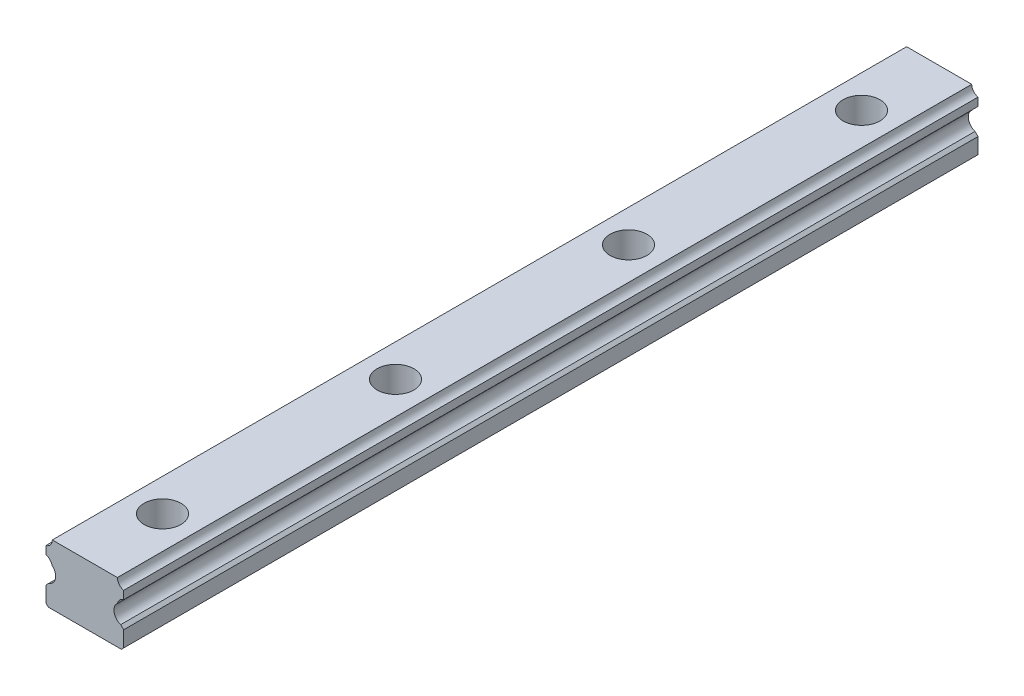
ISO-10303-21;
HEADER;
FILE_DESCRIPTION(('STEP AP214'),'2;1');
FILE_NAME('part.step','',(''),(''),'','','');
FILE_SCHEMA(('AUTOMOTIVE_DESIGN { 1 0 10303 214 1 1 1 1 }'));
ENDSEC;
DATA;
#1=APPLICATION_CONTEXT('core data for automotive mechanical design processes');
#2=APPLICATION_PROTOCOL_DEFINITION('international standard','automotive_design',2000,#1);
#3=PRODUCT_CONTEXT('',#1,'mechanical');
#4=PRODUCT('Part','Part','',(#3));
#5=PRODUCT_RELATED_PRODUCT_CATEGORY('part','',(#4));
#6=PRODUCT_DEFINITION_FORMATION('','',#4);
#7=PRODUCT_DEFINITION_CONTEXT('part definition',#1,'design');
#8=PRODUCT_DEFINITION('design','',#6,#7);
#9=PRODUCT_DEFINITION_SHAPE('','',#8);
#10=(LENGTH_UNIT() NAMED_UNIT(*) SI_UNIT(.MILLI.,.METRE.));
#11=(NAMED_UNIT(*) PLANE_ANGLE_UNIT() SI_UNIT($,.RADIAN.));
#12=(NAMED_UNIT(*) SI_UNIT($,.STERADIAN.) SOLID_ANGLE_UNIT());
#13=UNCERTAINTY_MEASURE_WITH_UNIT(LENGTH_MEASURE(1.E-05),#10,'distance_accuracy_value','');
#14=(GEOMETRIC_REPRESENTATION_CONTEXT(3) GLOBAL_UNCERTAINTY_ASSIGNED_CONTEXT((#13)) GLOBAL_UNIT_ASSIGNED_CONTEXT((#10,
#11,#12)) REPRESENTATION_CONTEXT('',''));
#15=CARTESIAN_POINT('',(0.,0.,0.));
#16=DIRECTION('',(0.,0.,1.));
#17=DIRECTION('',(1.,0.,0.));
#18=AXIS2_PLACEMENT_3D('',#15,#16,#17);
#19=CARTESIAN_POINT('',(-9.4,0.,110.));
#20=DIRECTION('',(0.,1.,0.));
#21=DIRECTION('',(0.,0.,1.));
#22=AXIS2_PLACEMENT_3D('',#19,#20,#21);
#23=PLANE('',#22);
#24=CARTESIAN_POINT('',(0.,0.,30.));
#25=DIRECTION('',(0.,1.,0.));
#26=DIRECTION('',(0.,0.,1.));
#27=AXIS2_PLACEMENT_3D('',#24,#25,#26);
#28=CIRCLE('',#27,3.);
#29=CARTESIAN_POINT('',(0.,0.,33.));
#30=VERTEX_POINT('',#29);
#31=EDGE_CURVE('E627',#30,#30,#28,.T.);
#32=ORIENTED_EDGE('',*,*,#31,.T.);
#33=EDGE_LOOP('',(#32));
#34=FACE_BOUND('',#33,.T.);
#35=CARTESIAN_POINT('',(0.,0.,-90.));
#36=DIRECTION('',(0.,1.,0.));
#37=DIRECTION('',(0.,0.,1.));
#38=AXIS2_PLACEMENT_3D('',#35,#36,#37);
#39=CIRCLE('',#38,3.);
#40=CARTESIAN_POINT('',(0.,0.,-87.));
#41=VERTEX_POINT('',#40);
#42=EDGE_CURVE('E601',#41,#41,#39,.T.);
#43=ORIENTED_EDGE('',*,*,#42,.T.);
#44=EDGE_LOOP('',(#43));
#45=FACE_BOUND('',#44,.T.);
#46=DIRECTION('',(0.,0.,-1.));
#47=VECTOR('',#46,1.);
#48=CARTESIAN_POINT('',(-9.4,0.,110.));
#49=LINE('',#48,#47);
#50=CARTESIAN_POINT('',(-9.4,0.,110.));
#51=VERTEX_POINT('',#50);
#52=CARTESIAN_POINT('',(-9.4,0.,-110.));
#53=VERTEX_POINT('',#52);
#54=EDGE_CURVE('E39',#51,#53,#49,.T.);
#55=ORIENTED_EDGE('',*,*,#54,.T.);
#56=DIRECTION('',(1.,0.,0.));
#57=VECTOR('',#56,1.);
#58=CARTESIAN_POINT('',(-9.4,0.,-110.));
#59=LINE('',#58,#57);
#60=CARTESIAN_POINT('',(9.4,0.,-110.));
#61=VERTEX_POINT('',#60);
#62=EDGE_CURVE('E160',#53,#61,#59,.T.);
#63=ORIENTED_EDGE('',*,*,#62,.T.);
#64=DIRECTION('',(0.,0.,-1.));
#65=VECTOR('',#64,1.);
#66=CARTESIAN_POINT('',(9.4,0.,110.));
#67=LINE('',#66,#65);
#68=CARTESIAN_POINT('',(9.4,0.,110.));
#69=VERTEX_POINT('',#68);
#70=EDGE_CURVE('E263',#69,#61,#67,.T.);
#71=ORIENTED_EDGE('',*,*,#70,.F.);
#72=DIRECTION('',(1.,0.,0.));
#73=VECTOR('',#72,1.);
#74=CARTESIAN_POINT('',(-9.4,0.,110.));
#75=LINE('',#74,#73);
#76=EDGE_CURVE('E212',#51,#69,#75,.T.);
#77=ORIENTED_EDGE('',*,*,#76,.F.);
#78=EDGE_LOOP('',(#55,#63,#71,#77));
#79=FACE_BOUND('',#78,.T.);
#80=CARTESIAN_POINT('',(0.,0.,90.));
#81=DIRECTION('',(0.,1.,0.));
#82=DIRECTION('',(0.,0.,1.));
#83=AXIS2_PLACEMENT_3D('',#80,#81,#82);
#84=CIRCLE('',#83,3.);
#85=CARTESIAN_POINT('',(0.,0.,93.));
#86=VERTEX_POINT('',#85);
#87=EDGE_CURVE('E615',#86,#86,#84,.T.);
#88=ORIENTED_EDGE('',*,*,#87,.T.);
#89=EDGE_LOOP('',(#88));
#90=FACE_BOUND('',#89,.T.);
#91=CARTESIAN_POINT('',(0.,0.,-30.));
#92=DIRECTION('',(0.,1.,0.));
#93=DIRECTION('',(0.,0.,1.));
#94=AXIS2_PLACEMENT_3D('',#91,#92,#93);
#95=CIRCLE('',#94,3.);
#96=CARTESIAN_POINT('',(0.,0.,-27.));
#97=VERTEX_POINT('',#96);
#98=EDGE_CURVE('E637',#97,#97,#95,.T.);
#99=ORIENTED_EDGE('',*,*,#98,.T.);
#100=EDGE_LOOP('',(#99));
#101=FACE_BOUND('',#100,.T.);
#102=ADVANCED_FACE('F31',(#34,#45,#79,#90,#101),#23,.F.);
#103=CARTESIAN_POINT('',(8.382,15.5,110.));
#104=DIRECTION('',(0.,-1.,0.));
#105=DIRECTION('',(0.,0.,-1.));
#106=AXIS2_PLACEMENT_3D('',#103,#104,#105);
#107=PLANE('',#106);
#108=CARTESIAN_POINT('',(0.,15.5,30.));
#109=DIRECTION('',(0.,1.,0.));
#110=DIRECTION('',(0.,0.,1.));
#111=AXIS2_PLACEMENT_3D('',#108,#109,#110);
#112=CIRCLE('',#111,4.75);
#113=CARTESIAN_POINT('',(0.,15.5,34.75));
#114=VERTEX_POINT('',#113);
#115=EDGE_CURVE('E618',#114,#114,#112,.T.);
#116=ORIENTED_EDGE('',*,*,#115,.F.);
#117=EDGE_LOOP('',(#116));
#118=FACE_BOUND('',#117,.T.);
#119=CARTESIAN_POINT('',(0.,15.5,-90.));
#120=DIRECTION('',(0.,1.,0.));
#121=DIRECTION('',(0.,0.,1.));
#122=AXIS2_PLACEMENT_3D('',#119,#120,#121);
#123=CIRCLE('',#122,4.75);
#124=CARTESIAN_POINT('',(0.,15.5,-85.25));
#125=VERTEX_POINT('',#124);
#126=EDGE_CURVE('E163',#125,#125,#123,.T.);
#127=ORIENTED_EDGE('',*,*,#126,.F.);
#128=EDGE_LOOP('',(#127));
#129=FACE_BOUND('',#128,.T.);
#130=DIRECTION('',(0.,0.,-1.));
#131=VECTOR('',#130,1.);
#132=CARTESIAN_POINT('',(8.382,15.5,110.));
#133=LINE('',#132,#131);
#134=CARTESIAN_POINT('',(8.382,15.5,110.));
#135=VERTEX_POINT('',#134);
#136=CARTESIAN_POINT('',(8.382,15.5,-110.));
#137=VERTEX_POINT('',#136);
#138=EDGE_CURVE('E249',#135,#137,#133,.T.);
#139=ORIENTED_EDGE('',*,*,#138,.T.);
#140=DIRECTION('',(-1.,0.,0.));
#141=VECTOR('',#140,1.);
#142=CARTESIAN_POINT('',(8.382,15.5,-110.));
#143=LINE('',#142,#141);
#144=CARTESIAN_POINT('',(-8.382,15.5,-110.));
#145=VERTEX_POINT('',#144);
#146=EDGE_CURVE('E192',#137,#145,#143,.T.);
#147=ORIENTED_EDGE('',*,*,#146,.T.);
#148=DIRECTION('',(0.,0.,-1.));
#149=VECTOR('',#148,1.);
#150=CARTESIAN_POINT('',(-8.382,15.5,110.));
#151=LINE('',#150,#149);
#152=CARTESIAN_POINT('',(-8.382,15.5,110.));
#153=VERTEX_POINT('',#152);
#154=EDGE_CURVE('E247',#153,#145,#151,.T.);
#155=ORIENTED_EDGE('',*,*,#154,.F.);
#156=DIRECTION('',(-1.,0.,0.));
#157=VECTOR('',#156,1.);
#158=CARTESIAN_POINT('',(8.382,15.5,110.));
#159=LINE('',#158,#157);
#160=EDGE_CURVE('E228',#135,#153,#159,.T.);
#161=ORIENTED_EDGE('',*,*,#160,.F.);
#162=EDGE_LOOP('',(#139,#147,#155,#161));
#163=FACE_BOUND('',#162,.T.);
#164=CARTESIAN_POINT('',(0.,15.5,90.));
#165=DIRECTION('',(0.,1.,0.));
#166=DIRECTION('',(0.,0.,1.));
#167=AXIS2_PLACEMENT_3D('',#164,#165,#166);
#168=CIRCLE('',#167,4.75);
#169=CARTESIAN_POINT('',(0.,15.5,94.75));
#170=VERTEX_POINT('',#169);
#171=EDGE_CURVE('E606',#170,#170,#168,.T.);
#172=ORIENTED_EDGE('',*,*,#171,.F.);
#173=EDGE_LOOP('',(#172));
#174=FACE_BOUND('',#173,.T.);
#175=CARTESIAN_POINT('',(0.,15.5,-30.));
#176=DIRECTION('',(0.,1.,0.));
#177=DIRECTION('',(0.,0.,1.));
#178=AXIS2_PLACEMENT_3D('',#175,#176,#177);
#179=CIRCLE('',#178,4.75);
#180=CARTESIAN_POINT('',(0.,15.5,-25.25));
#181=VERTEX_POINT('',#180);
#182=EDGE_CURVE('E629',#181,#181,#179,.T.);
#183=ORIENTED_EDGE('',*,*,#182,.F.);
#184=EDGE_LOOP('',(#183));
#185=FACE_BOUND('',#184,.T.);
#186=ADVANCED_FACE('F307',(#118,#129,#163,#174,#185),#107,.F.);
#187=CARTESIAN_POINT('',(-10.,4.652,110.));
#188=DIRECTION('',(1.,0.,0.));
#189=DIRECTION('',(0.,0.,-1.));
#190=AXIS2_PLACEMENT_3D('',#187,#188,#189);
#191=PLANE('',#190);
#192=DIRECTION('',(0.,0.,-1.));
#193=VECTOR('',#192,1.);
#194=CARTESIAN_POINT('',(-10.,4.652,110.));
#195=LINE('',#194,#193);
#196=CARTESIAN_POINT('',(-10.,4.652,110.));
#197=VERTEX_POINT('',#196);
#198=CARTESIAN_POINT('',(-10.,4.652,-110.));
#199=VERTEX_POINT('',#198);
#200=EDGE_CURVE('E162',#197,#199,#195,.T.);
#201=ORIENTED_EDGE('',*,*,#200,.T.);
#202=DIRECTION('',(0.,-1.,0.));
#203=VECTOR('',#202,1.);
#204=CARTESIAN_POINT('',(-10.,4.652,-110.));
#205=LINE('',#204,#203);
#206=CARTESIAN_POINT('',(-10.,0.6,-110.));
#207=VERTEX_POINT('',#206);
#208=EDGE_CURVE('E156',#199,#207,#205,.T.);
#209=ORIENTED_EDGE('',*,*,#208,.T.);
#210=DIRECTION('',(0.,0.,-1.));
#211=VECTOR('',#210,1.);
#212=CARTESIAN_POINT('',(-10.,0.6,110.));
#213=LINE('',#212,#211);
#214=CARTESIAN_POINT('',(-10.,0.6,110.));
#215=VERTEX_POINT('',#214);
#216=EDGE_CURVE('E11',#215,#207,#213,.T.);
#217=ORIENTED_EDGE('',*,*,#216,.F.);
#218=DIRECTION('',(0.,-1.,0.));
#219=VECTOR('',#218,1.);
#220=CARTESIAN_POINT('',(-10.,4.652,110.));
#221=LINE('',#220,#219);
#222=EDGE_CURVE('E209',#197,#215,#221,.T.);
#223=ORIENTED_EDGE('',*,*,#222,.F.);
#224=EDGE_LOOP('',(#201,#209,#217,#223));
#225=FACE_BOUND('',#224,.T.);
#226=ADVANCED_FACE('F33',(#225),#191,.F.);
#227=CARTESIAN_POINT('',(-10.,0.6,110.));
#228=DIRECTION('',(0.707106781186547,0.707106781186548,0.));
#229=DIRECTION('',(-0.707106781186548,0.707106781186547,0.));
#230=AXIS2_PLACEMENT_3D('',#227,#228,#229);
#231=PLANE('',#230);
#232=ORIENTED_EDGE('',*,*,#216,.T.);
#233=DIRECTION('',(0.707106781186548,-0.707106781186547,0.));
#234=VECTOR('',#233,1.);
#235=CARTESIAN_POINT('',(-10.,0.6,-110.));
#236=LINE('',#235,#234);
#237=EDGE_CURVE('E146',#207,#53,#236,.T.);
#238=ORIENTED_EDGE('',*,*,#237,.T.);
#239=ORIENTED_EDGE('',*,*,#54,.F.);
#240=DIRECTION('',(0.707106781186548,-0.707106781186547,0.));
#241=VECTOR('',#240,1.);
#242=CARTESIAN_POINT('',(-10.,0.6,110.));
#243=LINE('',#242,#241);
#244=EDGE_CURVE('E147',#215,#51,#243,.T.);
#245=ORIENTED_EDGE('',*,*,#244,.F.);
#246=EDGE_LOOP('',(#232,#238,#239,#245));
#247=FACE_BOUND('',#246,.T.);
#248=ADVANCED_FACE('F144',(#247),#231,.F.);
#249=CARTESIAN_POINT('',(9.4,0.,110.));
#250=DIRECTION('',(-0.707106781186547,0.707106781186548,0.));
#251=DIRECTION('',(-0.707106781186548,-0.707106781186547,0.));
#252=AXIS2_PLACEMENT_3D('',#249,#250,#251);
#253=PLANE('',#252);
#254=ORIENTED_EDGE('',*,*,#70,.T.);
#255=DIRECTION('',(0.707106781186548,0.707106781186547,0.));
#256=VECTOR('',#255,1.);
#257=CARTESIAN_POINT('',(9.4,0.,-110.));
#258=LINE('',#257,#256);
#259=CARTESIAN_POINT('',(10.,0.6,-110.));
#260=VERTEX_POINT('',#259);
#261=EDGE_CURVE('E171',#61,#260,#258,.T.);
#262=ORIENTED_EDGE('',*,*,#261,.T.);
#263=DIRECTION('',(0.,0.,-1.));
#264=VECTOR('',#263,1.);
#265=CARTESIAN_POINT('',(10.,0.6,110.));
#266=LINE('',#265,#264);
#267=CARTESIAN_POINT('',(10.,0.6,110.));
#268=VERTEX_POINT('',#267);
#269=EDGE_CURVE('E261',#268,#260,#266,.T.);
#270=ORIENTED_EDGE('',*,*,#269,.F.);
#271=DIRECTION('',(0.707106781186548,0.707106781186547,0.));
#272=VECTOR('',#271,1.);
#273=CARTESIAN_POINT('',(9.4,0.,110.));
#274=LINE('',#273,#272);
#275=EDGE_CURVE('E214',#69,#268,#274,.T.);
#276=ORIENTED_EDGE('',*,*,#275,.F.);
#277=EDGE_LOOP('',(#254,#262,#270,#276));
#278=FACE_BOUND('',#277,.T.);
#279=ADVANCED_FACE('F274',(#278),#253,.F.);
#280=CARTESIAN_POINT('',(10.,0.6,110.));
#281=DIRECTION('',(-1.,0.,0.));
#282=DIRECTION('',(0.,-1.,0.));
#283=AXIS2_PLACEMENT_3D('',#280,#281,#282);
#284=PLANE('',#283);
#285=ORIENTED_EDGE('',*,*,#269,.T.);
#286=DIRECTION('',(0.,1.,0.));
#287=VECTOR('',#286,1.);
#288=CARTESIAN_POINT('',(10.,0.6,-110.));
#289=LINE('',#288,#287);
#290=CARTESIAN_POINT('',(10.,4.652,-110.));
#291=VERTEX_POINT('',#290);
#292=EDGE_CURVE('E174',#260,#291,#289,.T.);
#293=ORIENTED_EDGE('',*,*,#292,.T.);
#294=DIRECTION('',(0.,0.,-1.));
#295=VECTOR('',#294,1.);
#296=CARTESIAN_POINT('',(10.,4.652,110.));
#297=LINE('',#296,#295);
#298=CARTESIAN_POINT('',(10.,4.652,110.));
#299=VERTEX_POINT('',#298);
#300=EDGE_CURVE('E259',#299,#291,#297,.T.);
#301=ORIENTED_EDGE('',*,*,#300,.F.);
#302=DIRECTION('',(0.,1.,0.));
#303=VECTOR('',#302,1.);
#304=CARTESIAN_POINT('',(10.,0.6,110.));
#305=LINE('',#304,#303);
#306=EDGE_CURVE('E216',#268,#299,#305,.T.);
#307=ORIENTED_EDGE('',*,*,#306,.F.);
#308=EDGE_LOOP('',(#285,#293,#301,#307));
#309=FACE_BOUND('',#308,.T.);
#310=ADVANCED_FACE('F277',(#309),#284,.F.);
#311=CARTESIAN_POINT('',(10.,4.652,110.));
#312=DIRECTION('',(-0.707106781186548,-0.707106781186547,0.));
#313=DIRECTION('',(0.707106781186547,-0.707106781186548,0.));
#314=AXIS2_PLACEMENT_3D('',#311,#312,#313);
#315=PLANE('',#314);
#316=ORIENTED_EDGE('',*,*,#300,.T.);
#317=DIRECTION('',(-0.707106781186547,0.707106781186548,0.));
#318=VECTOR('',#317,1.);
#319=CARTESIAN_POINT('',(10.,4.652,-110.));
#320=LINE('',#319,#318);
#321=CARTESIAN_POINT('',(9.23068875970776,5.42131124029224,-110.));
#322=VERTEX_POINT('',#321);
#323=EDGE_CURVE('E177',#291,#322,#320,.T.);
#324=ORIENTED_EDGE('',*,*,#323,.T.);
#325=DIRECTION('',(0.,0.,-1.));
#326=VECTOR('',#325,1.);
#327=CARTESIAN_POINT('',(9.23068875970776,5.42131124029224,110.));
#328=LINE('',#327,#326);
#329=CARTESIAN_POINT('',(9.23068875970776,5.42131124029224,110.));
#330=VERTEX_POINT('',#329);
#331=EDGE_CURVE('E257',#330,#322,#328,.T.);
#332=ORIENTED_EDGE('',*,*,#331,.F.);
#333=DIRECTION('',(-0.707106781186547,0.707106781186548,0.));
#334=VECTOR('',#333,1.);
#335=CARTESIAN_POINT('',(10.,4.652,110.));
#336=LINE('',#335,#334);
#337=EDGE_CURVE('E218',#299,#330,#336,.T.);
#338=ORIENTED_EDGE('',*,*,#337,.F.);
#339=EDGE_LOOP('',(#316,#324,#332,#338));
#340=FACE_BOUND('',#339,.T.);
#341=ADVANCED_FACE('F282',(#340),#315,.F.);
#342=CARTESIAN_POINT('',(10.,7.8,110.));
#343=DIRECTION('',(0.,0.,-1.));
#344=DIRECTION('',(-1.,0.,0.));
#345=AXIS2_PLACEMENT_3D('',#342,#343,#344);
#346=CYLINDRICAL_SURFACE('',#345,2.5);
#347=ORIENTED_EDGE('',*,*,#331,.T.);
#348=CARTESIAN_POINT('',(10.,7.8,-110.));
#349=DIRECTION('',(0.,0.,-1.));
#350=DIRECTION('',(-1.,0.,0.));
#351=AXIS2_PLACEMENT_3D('',#348,#349,#350);
#352=CIRCLE('',#351,2.5);
#353=CARTESIAN_POINT('',(8.42517245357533,9.74162771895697,-110.));
#354=VERTEX_POINT('',#353);
#355=EDGE_CURVE('E180',#322,#354,#352,.T.);
#356=ORIENTED_EDGE('',*,*,#355,.T.);
#357=DIRECTION('',(0.,0.,-1.));
#358=VECTOR('',#357,1.);
#359=CARTESIAN_POINT('',(8.42517245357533,9.74162771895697,110.));
#360=LINE('',#359,#358);
#361=CARTESIAN_POINT('',(8.42517245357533,9.74162771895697,110.));
#362=VERTEX_POINT('',#361);
#363=EDGE_CURVE('E255',#362,#354,#360,.T.);
#364=ORIENTED_EDGE('',*,*,#363,.F.);
#365=CARTESIAN_POINT('',(10.,7.8,110.));
#366=DIRECTION('',(0.,0.,-1.));
#367=DIRECTION('',(-1.,0.,0.));
#368=AXIS2_PLACEMENT_3D('',#365,#366,#367);
#369=CIRCLE('',#368,2.5);
#370=EDGE_CURVE('E220',#330,#362,#369,.T.);
#371=ORIENTED_EDGE('',*,*,#370,.F.);
#372=EDGE_LOOP('',(#347,#356,#364,#371));
#373=FACE_BOUND('',#372,.T.);
#374=ADVANCED_FACE('F288',(#373),#346,.F.);
#375=CARTESIAN_POINT('',(10.482,9.31799999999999,110.));
#376=DIRECTION('',(0.,0.,-1.));
#377=DIRECTION('',(-1.,0.,0.));
#378=AXIS2_PLACEMENT_3D('',#375,#376,#377);
#379=CYLINDRICAL_SURFACE('',#378,2.10000000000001);
#380=ORIENTED_EDGE('',*,*,#363,.T.);
#381=CARTESIAN_POINT('',(10.482,9.31799999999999,-110.));
#382=DIRECTION('',(0.,0.,-1.));
#383=DIRECTION('',(-1.,0.,0.));
#384=AXIS2_PLACEMENT_3D('',#381,#382,#383);
#385=CIRCLE('',#384,2.10000000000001);
#386=CARTESIAN_POINT('',(10.,11.3619363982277,-110.));
#387=VERTEX_POINT('',#386);
#388=EDGE_CURVE('E183',#354,#387,#385,.T.);
#389=ORIENTED_EDGE('',*,*,#388,.T.);
#390=DIRECTION('',(0.,0.,-1.));
#391=VECTOR('',#390,1.);
#392=CARTESIAN_POINT('',(10.,11.3619363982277,110.));
#393=LINE('',#392,#391);
#394=CARTESIAN_POINT('',(10.,11.3619363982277,110.));
#395=VERTEX_POINT('',#394);
#396=EDGE_CURVE('E253',#395,#387,#393,.T.);
#397=ORIENTED_EDGE('',*,*,#396,.F.);
#398=CARTESIAN_POINT('',(10.482,9.31799999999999,110.));
#399=DIRECTION('',(0.,0.,-1.));
#400=DIRECTION('',(-1.,0.,0.));
#401=AXIS2_PLACEMENT_3D('',#398,#399,#400);
#402=CIRCLE('',#401,2.10000000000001);
#403=EDGE_CURVE('E222',#362,#395,#402,.T.);
#404=ORIENTED_EDGE('',*,*,#403,.F.);
#405=EDGE_LOOP('',(#380,#389,#397,#404));
#406=FACE_BOUND('',#405,.T.);
#407=ADVANCED_FACE('F292',(#406),#379,.F.);
#408=CARTESIAN_POINT('',(10.,11.3619363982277,110.));
#409=DIRECTION('',(-1.,0.,0.));
#410=DIRECTION('',(0.,0.,1.));
#411=AXIS2_PLACEMENT_3D('',#408,#409,#410);
#412=PLANE('',#411);
#413=ORIENTED_EDGE('',*,*,#396,.T.);
#414=DIRECTION('',(0.,1.,0.));
#415=VECTOR('',#414,1.);
#416=CARTESIAN_POINT('',(10.,11.3619363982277,-110.));
#417=LINE('',#416,#415);
#418=CARTESIAN_POINT('',(10.,13.4560636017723,-110.));
#419=VERTEX_POINT('',#418);
#420=EDGE_CURVE('E186',#387,#419,#417,.T.);
#421=ORIENTED_EDGE('',*,*,#420,.T.);
#422=DIRECTION('',(0.,0.,-1.));
#423=VECTOR('',#422,1.);
#424=CARTESIAN_POINT('',(10.,13.4560636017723,110.));
#425=LINE('',#424,#423);
#426=CARTESIAN_POINT('',(10.,13.4560636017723,110.));
#427=VERTEX_POINT('',#426);
#428=EDGE_CURVE('E251',#427,#419,#425,.T.);
#429=ORIENTED_EDGE('',*,*,#428,.F.);
#430=DIRECTION('',(0.,1.,0.));
#431=VECTOR('',#430,1.);
#432=CARTESIAN_POINT('',(10.,11.3619363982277,110.));
#433=LINE('',#432,#431);
#434=EDGE_CURVE('E224',#395,#427,#433,.T.);
#435=ORIENTED_EDGE('',*,*,#434,.F.);
#436=EDGE_LOOP('',(#413,#421,#429,#435));
#437=FACE_BOUND('',#436,.T.);
#438=ADVANCED_FACE('F297',(#437),#412,.F.);
#439=CARTESIAN_POINT('',(10.482,15.5,110.));
#440=DIRECTION('',(0.,0.,-1.));
#441=DIRECTION('',(-1.,0.,0.));
#442=AXIS2_PLACEMENT_3D('',#439,#440,#441);
#443=CYLINDRICAL_SURFACE('',#442,2.1);
#444=ORIENTED_EDGE('',*,*,#428,.T.);
#445=CARTESIAN_POINT('',(10.482,15.5,-110.));
#446=DIRECTION('',(0.,0.,-1.));
#447=DIRECTION('',(-1.,0.,0.));
#448=AXIS2_PLACEMENT_3D('',#445,#446,#447);
#449=CIRCLE('',#448,2.1);
#450=EDGE_CURVE('E189',#419,#137,#449,.T.);
#451=ORIENTED_EDGE('',*,*,#450,.T.);
#452=ORIENTED_EDGE('',*,*,#138,.F.);
#453=CARTESIAN_POINT('',(10.482,15.5,110.));
#454=DIRECTION('',(0.,0.,-1.));
#455=DIRECTION('',(-1.,0.,0.));
#456=AXIS2_PLACEMENT_3D('',#453,#454,#455);
#457=CIRCLE('',#456,2.1);
#458=EDGE_CURVE('E226',#427,#135,#457,.T.);
#459=ORIENTED_EDGE('',*,*,#458,.F.);
#460=EDGE_LOOP('',(#444,#451,#452,#459));
#461=FACE_BOUND('',#460,.T.);
#462=ADVANCED_FACE('F303',(#461),#443,.F.);
#463=CARTESIAN_POINT('',(-10.482,15.5,110.));
#464=DIRECTION('',(0.,0.,-1.));
#465=DIRECTION('',(-1.,0.,0.));
#466=AXIS2_PLACEMENT_3D('',#463,#464,#465);
#467=CYLINDRICAL_SURFACE('',#466,2.10000000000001);
#468=ORIENTED_EDGE('',*,*,#154,.T.);
#469=CARTESIAN_POINT('',(-10.482,15.5,-110.));
#470=DIRECTION('',(0.,0.,-1.));
#471=DIRECTION('',(-1.,0.,0.));
#472=AXIS2_PLACEMENT_3D('',#469,#470,#471);
#473=CIRCLE('',#472,2.10000000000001);
#474=CARTESIAN_POINT('',(-10.,13.4560636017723,-110.));
#475=VERTEX_POINT('',#474);
#476=EDGE_CURVE('E195',#145,#475,#473,.T.);
#477=ORIENTED_EDGE('',*,*,#476,.T.);
#478=DIRECTION('',(0.,0.,-1.));
#479=VECTOR('',#478,1.);
#480=CARTESIAN_POINT('',(-10.,13.4560636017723,110.));
#481=LINE('',#480,#479);
#482=CARTESIAN_POINT('',(-10.,13.4560636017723,110.));
#483=VERTEX_POINT('',#482);
#484=EDGE_CURVE('E245',#483,#475,#481,.T.);
#485=ORIENTED_EDGE('',*,*,#484,.F.);
#486=CARTESIAN_POINT('',(-10.482,15.5,110.));
#487=DIRECTION('',(0.,0.,-1.));
#488=DIRECTION('',(-1.,0.,0.));
#489=AXIS2_PLACEMENT_3D('',#486,#487,#488);
#490=CIRCLE('',#489,2.10000000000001);
#491=EDGE_CURVE('E230',#153,#483,#490,.T.);
#492=ORIENTED_EDGE('',*,*,#491,.F.);
#493=EDGE_LOOP('',(#468,#477,#485,#492));
#494=FACE_BOUND('',#493,.T.);
#495=ADVANCED_FACE('F313',(#494),#467,.F.);
#496=CARTESIAN_POINT('',(-10.,13.4560636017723,110.));
#497=DIRECTION('',(1.,0.,0.));
#498=DIRECTION('',(0.,0.,-1.));
#499=AXIS2_PLACEMENT_3D('',#496,#497,#498);
#500=PLANE('',#499);
#501=ORIENTED_EDGE('',*,*,#484,.T.);
#502=DIRECTION('',(0.,-1.,0.));
#503=VECTOR('',#502,1.);
#504=CARTESIAN_POINT('',(-10.,13.4560636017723,-110.));
#505=LINE('',#504,#503);
#506=CARTESIAN_POINT('',(-10.,11.3619363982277,-110.));
#507=VERTEX_POINT('',#506);
#508=EDGE_CURVE('E198',#475,#507,#505,.T.);
#509=ORIENTED_EDGE('',*,*,#508,.T.);
#510=DIRECTION('',(0.,0.,-1.));
#511=VECTOR('',#510,1.);
#512=CARTESIAN_POINT('',(-10.,11.3619363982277,110.));
#513=LINE('',#512,#511);
#514=CARTESIAN_POINT('',(-10.,11.3619363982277,110.));
#515=VERTEX_POINT('',#514);
#516=EDGE_CURVE('E243',#515,#507,#513,.T.);
#517=ORIENTED_EDGE('',*,*,#516,.F.);
#518=DIRECTION('',(0.,-1.,0.));
#519=VECTOR('',#518,1.);
#520=CARTESIAN_POINT('',(-10.,13.4560636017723,110.));
#521=LINE('',#520,#519);
#522=EDGE_CURVE('E232',#483,#515,#521,.T.);
#523=ORIENTED_EDGE('',*,*,#522,.F.);
#524=EDGE_LOOP('',(#501,#509,#517,#523));
#525=FACE_BOUND('',#524,.T.);
#526=ADVANCED_FACE('F319',(#525),#500,.F.);
#527=CARTESIAN_POINT('',(-10.482,9.31799999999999,110.));
#528=DIRECTION('',(0.,0.,-1.));
#529=DIRECTION('',(-1.,0.,0.));
#530=AXIS2_PLACEMENT_3D('',#527,#528,#529);
#531=CYLINDRICAL_SURFACE('',#530,2.10000000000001);
#532=ORIENTED_EDGE('',*,*,#516,.T.);
#533=CARTESIAN_POINT('',(-10.482,9.31799999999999,-110.));
#534=DIRECTION('',(0.,0.,-1.));
#535=DIRECTION('',(-1.,0.,0.));
#536=AXIS2_PLACEMENT_3D('',#533,#534,#535);
#537=CIRCLE('',#536,2.10000000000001);
#538=CARTESIAN_POINT('',(-8.42517245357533,9.74162771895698,-110.));
#539=VERTEX_POINT('',#538);
#540=EDGE_CURVE('E201',#507,#539,#537,.T.);
#541=ORIENTED_EDGE('',*,*,#540,.T.);
#542=DIRECTION('',(0.,0.,-1.));
#543=VECTOR('',#542,1.);
#544=CARTESIAN_POINT('',(-8.42517245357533,9.74162771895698,110.));
#545=LINE('',#544,#543);
#546=CARTESIAN_POINT('',(-8.42517245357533,9.74162771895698,110.));
#547=VERTEX_POINT('',#546);
#548=EDGE_CURVE('E241',#547,#539,#545,.T.);
#549=ORIENTED_EDGE('',*,*,#548,.F.);
#550=CARTESIAN_POINT('',(-10.482,9.31799999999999,110.));
#551=DIRECTION('',(0.,0.,-1.));
#552=DIRECTION('',(-1.,0.,0.));
#553=AXIS2_PLACEMENT_3D('',#550,#551,#552);
#554=CIRCLE('',#553,2.10000000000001);
#555=EDGE_CURVE('E234',#515,#547,#554,.T.);
#556=ORIENTED_EDGE('',*,*,#555,.F.);
#557=EDGE_LOOP('',(#532,#541,#549,#556));
#558=FACE_BOUND('',#557,.T.);
#559=ADVANCED_FACE('F323',(#558),#531,.F.);
#560=CARTESIAN_POINT('',(-10.,7.8,110.));
#561=DIRECTION('',(0.,0.,-1.));
#562=DIRECTION('',(-1.,0.,0.));
#563=AXIS2_PLACEMENT_3D('',#560,#561,#562);
#564=CYLINDRICAL_SURFACE('',#563,2.5);
#565=ORIENTED_EDGE('',*,*,#548,.T.);
#566=CARTESIAN_POINT('',(-10.,7.8,-110.));
#567=DIRECTION('',(0.,0.,-1.));
#568=DIRECTION('',(-1.,0.,0.));
#569=AXIS2_PLACEMENT_3D('',#566,#567,#568);
#570=CIRCLE('',#569,2.5);
#571=CARTESIAN_POINT('',(-9.23068875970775,5.42131124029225,-110.));
#572=VERTEX_POINT('',#571);
#573=EDGE_CURVE('E204',#539,#572,#570,.T.);
#574=ORIENTED_EDGE('',*,*,#573,.T.);
#575=DIRECTION('',(0.,0.,-1.));
#576=VECTOR('',#575,1.);
#577=CARTESIAN_POINT('',(-9.23068875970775,5.42131124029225,110.));
#578=LINE('',#577,#576);
#579=CARTESIAN_POINT('',(-9.23068875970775,5.42131124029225,110.));
#580=VERTEX_POINT('',#579);
#581=EDGE_CURVE('E239',#580,#572,#578,.T.);
#582=ORIENTED_EDGE('',*,*,#581,.F.);
#583=CARTESIAN_POINT('',(-10.,7.8,110.));
#584=DIRECTION('',(0.,0.,-1.));
#585=DIRECTION('',(-1.,0.,0.));
#586=AXIS2_PLACEMENT_3D('',#583,#584,#585);
#587=CIRCLE('',#586,2.5);
#588=EDGE_CURVE('E51',#547,#580,#587,.T.);
#589=ORIENTED_EDGE('',*,*,#588,.F.);
#590=EDGE_LOOP('',(#565,#574,#582,#589));
#591=FACE_BOUND('',#590,.T.);
#592=ADVANCED_FACE('F326',(#591),#564,.F.);
#593=CARTESIAN_POINT('',(-9.23068875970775,5.42131124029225,110.));
#594=DIRECTION('',(0.707106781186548,-0.707106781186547,0.));
#595=DIRECTION('',(0.707106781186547,0.707106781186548,0.));
#596=AXIS2_PLACEMENT_3D('',#593,#594,#595);
#597=PLANE('',#596);
#598=ORIENTED_EDGE('',*,*,#581,.T.);
#599=DIRECTION('',(-0.707106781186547,-0.707106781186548,0.));
#600=VECTOR('',#599,1.);
#601=CARTESIAN_POINT('',(-9.23068875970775,5.42131124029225,-110.));
#602=LINE('',#601,#600);
#603=EDGE_CURVE('E207',#572,#199,#602,.T.);
#604=ORIENTED_EDGE('',*,*,#603,.T.);
#605=ORIENTED_EDGE('',*,*,#200,.F.);
#606=DIRECTION('',(-0.707106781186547,-0.707106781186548,0.));
#607=VECTOR('',#606,1.);
#608=CARTESIAN_POINT('',(-9.23068875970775,5.42131124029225,110.));
#609=LINE('',#608,#607);
#610=EDGE_CURVE('E46',#580,#197,#609,.T.);
#611=ORIENTED_EDGE('',*,*,#610,.F.);
#612=EDGE_LOOP('',(#598,#604,#605,#611));
#613=FACE_BOUND('',#612,.T.);
#614=ADVANCED_FACE('F328',(#613),#597,.F.);
#615=CARTESIAN_POINT('',(10.,7.8,110.));
#616=DIRECTION('',(0.,0.,-1.));
#617=DIRECTION('',(-1.,0.,0.));
#618=AXIS2_PLACEMENT_3D('',#615,#616,#617);
#619=PLANE('',#618);
#620=ORIENTED_EDGE('',*,*,#222,.T.);
#621=ORIENTED_EDGE('',*,*,#244,.T.);
#622=ORIENTED_EDGE('',*,*,#76,.T.);
#623=ORIENTED_EDGE('',*,*,#275,.T.);
#624=ORIENTED_EDGE('',*,*,#306,.T.);
#625=ORIENTED_EDGE('',*,*,#337,.T.);
#626=ORIENTED_EDGE('',*,*,#370,.T.);
#627=ORIENTED_EDGE('',*,*,#403,.T.);
#628=ORIENTED_EDGE('',*,*,#434,.T.);
#629=ORIENTED_EDGE('',*,*,#458,.T.);
#630=ORIENTED_EDGE('',*,*,#160,.T.);
#631=ORIENTED_EDGE('',*,*,#491,.T.);
#632=ORIENTED_EDGE('',*,*,#522,.T.);
#633=ORIENTED_EDGE('',*,*,#555,.T.);
#634=ORIENTED_EDGE('',*,*,#588,.T.);
#635=ORIENTED_EDGE('',*,*,#610,.T.);
#636=EDGE_LOOP('',(#620,#621,#622,#623,#624,#625,#626,#627,#628,#629,#630,#631,#632,#633,#634,#635));
#637=FACE_BOUND('',#636,.T.);
#638=ADVANCED_FACE('F269',(#637),#619,.F.);
#639=CARTESIAN_POINT('',(10.,7.8,-110.));
#640=DIRECTION('',(0.,0.,-1.));
#641=DIRECTION('',(-1.,0.,0.));
#642=AXIS2_PLACEMENT_3D('',#639,#640,#641);
#643=PLANE('',#642);
#644=ORIENTED_EDGE('',*,*,#208,.F.);
#645=ORIENTED_EDGE('',*,*,#603,.F.);
#646=ORIENTED_EDGE('',*,*,#573,.F.);
#647=ORIENTED_EDGE('',*,*,#540,.F.);
#648=ORIENTED_EDGE('',*,*,#508,.F.);
#649=ORIENTED_EDGE('',*,*,#476,.F.);
#650=ORIENTED_EDGE('',*,*,#146,.F.);
#651=ORIENTED_EDGE('',*,*,#450,.F.);
#652=ORIENTED_EDGE('',*,*,#420,.F.);
#653=ORIENTED_EDGE('',*,*,#388,.F.);
#654=ORIENTED_EDGE('',*,*,#355,.F.);
#655=ORIENTED_EDGE('',*,*,#323,.F.);
#656=ORIENTED_EDGE('',*,*,#292,.F.);
#657=ORIENTED_EDGE('',*,*,#261,.F.);
#658=ORIENTED_EDGE('',*,*,#62,.F.);
#659=ORIENTED_EDGE('',*,*,#237,.F.);
#660=EDGE_LOOP('',(#644,#645,#646,#647,#648,#649,#650,#651,#652,#653,#654,#655,#656,#657,#658,#659));
#661=FACE_BOUND('',#660,.T.);
#662=ADVANCED_FACE('F154',(#661),#643,.T.);
#663=CARTESIAN_POINT('',(0.,0.,-90.));
#664=DIRECTION('',(0.,1.,0.));
#665=DIRECTION('',(0.,0.,1.));
#666=AXIS2_PLACEMENT_3D('',#663,#664,#665);
#667=CYLINDRICAL_SURFACE('',#666,4.75);
#668=ORIENTED_EDGE('',*,*,#126,.T.);
#669=EDGE_LOOP('',(#668));
#670=FACE_BOUND('',#669,.T.);
#671=CARTESIAN_POINT('',(0.,7.,-90.));
#672=DIRECTION('',(0.,1.,0.));
#673=DIRECTION('',(0.,0.,1.));
#674=AXIS2_PLACEMENT_3D('',#671,#672,#673);
#675=CIRCLE('',#674,4.75);
#676=CARTESIAN_POINT('',(0.,7.,-85.25));
#677=VERTEX_POINT('',#676);
#678=EDGE_CURVE('E166',#677,#677,#675,.T.);
#679=ORIENTED_EDGE('',*,*,#678,.F.);
#680=EDGE_LOOP('',(#679));
#681=FACE_BOUND('',#680,.T.);
#682=ADVANCED_FACE('F432',(#670,#681),#667,.F.);
#683=CARTESIAN_POINT('',(0.,7.,-94.75));
#684=DIRECTION('',(0.,1.,0.));
#685=DIRECTION('',(0.,0.,1.));
#686=AXIS2_PLACEMENT_3D('',#683,#684,#685);
#687=PLANE('',#686);
#688=ORIENTED_EDGE('',*,*,#678,.T.);
#689=EDGE_LOOP('',(#688));
#690=FACE_BOUND('',#689,.T.);
#691=CARTESIAN_POINT('',(0.,7.,-90.));
#692=DIRECTION('',(0.,1.,0.));
#693=DIRECTION('',(0.,0.,1.));
#694=AXIS2_PLACEMENT_3D('',#691,#692,#693);
#695=CIRCLE('',#694,3.);
#696=CARTESIAN_POINT('',(0.,7.,-87.));
#697=VERTEX_POINT('',#696);
#698=EDGE_CURVE('E599',#697,#697,#695,.T.);
#699=ORIENTED_EDGE('',*,*,#698,.F.);
#700=EDGE_LOOP('',(#699));
#701=FACE_BOUND('',#700,.T.);
#702=ADVANCED_FACE('F428',(#690,#701),#687,.T.);
#703=CARTESIAN_POINT('',(0.,0.,-90.));
#704=DIRECTION('',(0.,1.,0.));
#705=DIRECTION('',(0.,0.,1.));
#706=AXIS2_PLACEMENT_3D('',#703,#704,#705);
#707=CYLINDRICAL_SURFACE('',#706,3.);
#708=ORIENTED_EDGE('',*,*,#698,.T.);
#709=EDGE_LOOP('',(#708));
#710=FACE_BOUND('',#709,.T.);
#711=ORIENTED_EDGE('',*,*,#42,.F.);
#712=EDGE_LOOP('',(#711));
#713=FACE_BOUND('',#712,.T.);
#714=ADVANCED_FACE('F424',(#710,#713),#707,.F.);
#715=CARTESIAN_POINT('',(0.,0.,90.));
#716=DIRECTION('',(0.,1.,0.));
#717=DIRECTION('',(0.,0.,1.));
#718=AXIS2_PLACEMENT_3D('',#715,#716,#717);
#719=CYLINDRICAL_SURFACE('',#718,4.75);
#720=ORIENTED_EDGE('',*,*,#171,.T.);
#721=EDGE_LOOP('',(#720));
#722=FACE_BOUND('',#721,.T.);
#723=CARTESIAN_POINT('',(0.,7.,90.));
#724=DIRECTION('',(0.,1.,0.));
#725=DIRECTION('',(0.,0.,1.));
#726=AXIS2_PLACEMENT_3D('',#723,#724,#725);
#727=CIRCLE('',#726,4.75);
#728=CARTESIAN_POINT('',(0.,7.,94.75));
#729=VERTEX_POINT('',#728);
#730=EDGE_CURVE('E609',#729,#729,#727,.T.);
#731=ORIENTED_EDGE('',*,*,#730,.F.);
#732=EDGE_LOOP('',(#731));
#733=FACE_BOUND('',#732,.T.);
#734=ADVANCED_FACE('F420',(#722,#733),#719,.F.);
#735=CARTESIAN_POINT('',(0.,7.,85.25));
#736=DIRECTION('',(0.,1.,0.));
#737=DIRECTION('',(0.,0.,1.));
#738=AXIS2_PLACEMENT_3D('',#735,#736,#737);
#739=PLANE('',#738);
#740=ORIENTED_EDGE('',*,*,#730,.T.);
#741=EDGE_LOOP('',(#740));
#742=FACE_BOUND('',#741,.T.);
#743=CARTESIAN_POINT('',(0.,7.,90.));
#744=DIRECTION('',(0.,1.,0.));
#745=DIRECTION('',(0.,0.,1.));
#746=AXIS2_PLACEMENT_3D('',#743,#744,#745);
#747=CIRCLE('',#746,3.);
#748=CARTESIAN_POINT('',(0.,7.,93.));
#749=VERTEX_POINT('',#748);
#750=EDGE_CURVE('E612',#749,#749,#747,.T.);
#751=ORIENTED_EDGE('',*,*,#750,.F.);
#752=EDGE_LOOP('',(#751));
#753=FACE_BOUND('',#752,.T.);
#754=ADVANCED_FACE('F416',(#742,#753),#739,.T.);
#755=CARTESIAN_POINT('',(0.,0.,90.));
#756=DIRECTION('',(0.,1.,0.));
#757=DIRECTION('',(0.,0.,1.));
#758=AXIS2_PLACEMENT_3D('',#755,#756,#757);
#759=CYLINDRICAL_SURFACE('',#758,3.);
#760=ORIENTED_EDGE('',*,*,#750,.T.);
#761=EDGE_LOOP('',(#760));
#762=FACE_BOUND('',#761,.T.);
#763=ORIENTED_EDGE('',*,*,#87,.F.);
#764=EDGE_LOOP('',(#763));
#765=FACE_BOUND('',#764,.T.);
#766=ADVANCED_FACE('F412',(#762,#765),#759,.F.);
#767=CARTESIAN_POINT('',(0.,0.,30.));
#768=DIRECTION('',(0.,1.,0.));
#769=DIRECTION('',(0.,0.,1.));
#770=AXIS2_PLACEMENT_3D('',#767,#768,#769);
#771=CYLINDRICAL_SURFACE('',#770,4.75);
#772=ORIENTED_EDGE('',*,*,#115,.T.);
#773=EDGE_LOOP('',(#772));
#774=FACE_BOUND('',#773,.T.);
#775=CARTESIAN_POINT('',(0.,7.,30.));
#776=DIRECTION('',(0.,1.,0.));
#777=DIRECTION('',(0.,0.,1.));
#778=AXIS2_PLACEMENT_3D('',#775,#776,#777);
#779=CIRCLE('',#778,4.75);
#780=CARTESIAN_POINT('',(0.,7.,34.75));
#781=VERTEX_POINT('',#780);
#782=EDGE_CURVE('E621',#781,#781,#779,.T.);
#783=ORIENTED_EDGE('',*,*,#782,.F.);
#784=EDGE_LOOP('',(#783));
#785=FACE_BOUND('',#784,.T.);
#786=ADVANCED_FACE('F408',(#774,#785),#771,.F.);
#787=CARTESIAN_POINT('',(0.,7.,25.25));
#788=DIRECTION('',(0.,1.,0.));
#789=DIRECTION('',(0.,0.,1.));
#790=AXIS2_PLACEMENT_3D('',#787,#788,#789);
#791=PLANE('',#790);
#792=ORIENTED_EDGE('',*,*,#782,.T.);
#793=EDGE_LOOP('',(#792));
#794=FACE_BOUND('',#793,.T.);
#795=CARTESIAN_POINT('',(0.,7.,30.));
#796=DIRECTION('',(0.,1.,0.));
#797=DIRECTION('',(0.,0.,1.));
#798=AXIS2_PLACEMENT_3D('',#795,#796,#797);
#799=CIRCLE('',#798,3.);
#800=CARTESIAN_POINT('',(0.,7.,33.));
#801=VERTEX_POINT('',#800);
#802=EDGE_CURVE('E624',#801,#801,#799,.T.);
#803=ORIENTED_EDGE('',*,*,#802,.F.);
#804=EDGE_LOOP('',(#803));
#805=FACE_BOUND('',#804,.T.);
#806=ADVANCED_FACE('F404',(#794,#805),#791,.T.);
#807=CARTESIAN_POINT('',(0.,0.,30.));
#808=DIRECTION('',(0.,1.,0.));
#809=DIRECTION('',(0.,0.,1.));
#810=AXIS2_PLACEMENT_3D('',#807,#808,#809);
#811=CYLINDRICAL_SURFACE('',#810,3.);
#812=ORIENTED_EDGE('',*,*,#802,.T.);
#813=EDGE_LOOP('',(#812));
#814=FACE_BOUND('',#813,.T.);
#815=ORIENTED_EDGE('',*,*,#31,.F.);
#816=EDGE_LOOP('',(#815));
#817=FACE_BOUND('',#816,.T.);
#818=ADVANCED_FACE('F375',(#814,#817),#811,.F.);
#819=CARTESIAN_POINT('',(0.,0.,-30.));
#820=DIRECTION('',(0.,1.,0.));
#821=DIRECTION('',(0.,0.,1.));
#822=AXIS2_PLACEMENT_3D('',#819,#820,#821);
#823=CYLINDRICAL_SURFACE('',#822,4.75);
#824=ORIENTED_EDGE('',*,*,#182,.T.);
#825=EDGE_LOOP('',(#824));
#826=FACE_BOUND('',#825,.T.);
#827=CARTESIAN_POINT('',(0.,7.,-30.));
#828=DIRECTION('',(0.,1.,0.));
#829=DIRECTION('',(0.,0.,1.));
#830=AXIS2_PLACEMENT_3D('',#827,#828,#829);
#831=CIRCLE('',#830,4.75);
#832=CARTESIAN_POINT('',(0.,7.,-25.25));
#833=VERTEX_POINT('',#832);
#834=EDGE_CURVE('E632',#833,#833,#831,.T.);
#835=ORIENTED_EDGE('',*,*,#834,.F.);
#836=EDGE_LOOP('',(#835));
#837=FACE_BOUND('',#836,.T.);
#838=ADVANCED_FACE('F369',(#826,#837),#823,.F.);
#839=CARTESIAN_POINT('',(0.,7.,-34.75));
#840=DIRECTION('',(0.,1.,0.));
#841=DIRECTION('',(0.,0.,1.));
#842=AXIS2_PLACEMENT_3D('',#839,#840,#841);
#843=PLANE('',#842);
#844=ORIENTED_EDGE('',*,*,#834,.T.);
#845=EDGE_LOOP('',(#844));
#846=FACE_BOUND('',#845,.T.);
#847=CARTESIAN_POINT('',(0.,7.,-30.));
#848=DIRECTION('',(0.,1.,0.));
#849=DIRECTION('',(0.,0.,1.));
#850=AXIS2_PLACEMENT_3D('',#847,#848,#849);
#851=CIRCLE('',#850,3.);
#852=CARTESIAN_POINT('',(0.,7.,-27.));
#853=VERTEX_POINT('',#852);
#854=EDGE_CURVE('E635',#853,#853,#851,.T.);
#855=ORIENTED_EDGE('',*,*,#854,.F.);
#856=EDGE_LOOP('',(#855));
#857=FACE_BOUND('',#856,.T.);
#858=ADVANCED_FACE('F374',(#846,#857),#843,.T.);
#859=CARTESIAN_POINT('',(0.,0.,-30.));
#860=DIRECTION('',(0.,1.,0.));
#861=DIRECTION('',(0.,0.,1.));
#862=AXIS2_PLACEMENT_3D('',#859,#860,#861);
#863=CYLINDRICAL_SURFACE('',#862,3.);
#864=ORIENTED_EDGE('',*,*,#854,.T.);
#865=EDGE_LOOP('',(#864));
#866=FACE_BOUND('',#865,.T.);
#867=ORIENTED_EDGE('',*,*,#98,.F.);
#868=EDGE_LOOP('',(#867));
#869=FACE_BOUND('',#868,.T.);
#870=ADVANCED_FACE('F386',(#866,#869),#863,.F.);
#871=CLOSED_SHELL('',(#102,#186,#226,#248,#279,#310,#341,#374,#407,#438,#462,#495,#526,#559,
#592,#614,#638,#662,#682,#702,#714,#734,#754,#766,#786,#806,#818,#838,#858,#870));
#872=MANIFOLD_SOLID_BREP('B2',#871);
#873=ADVANCED_BREP_SHAPE_REPRESENTATION('',(#18,#872),#14);
#874=SHAPE_DEFINITION_REPRESENTATION(#9,#873);
ENDSEC;
END-ISO-10303-21;
